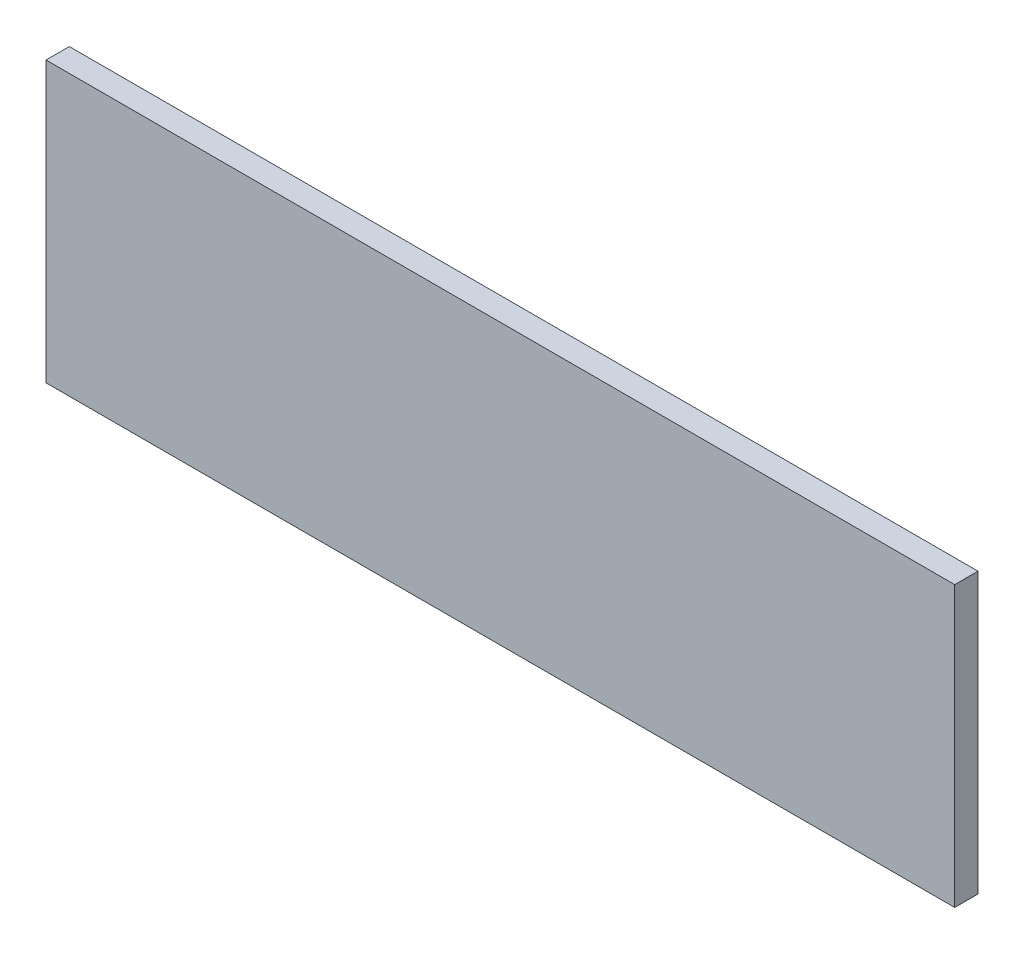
from build123d import *

# Parameters (mm, degrees)
SKETCH1_W           = 247.65
SKETCH1_H           = 76.2
BOSS_EXTRUDE1_DEPTH = 6.35


with BuildPart() as part:
    # Sketch1 → Boss-Extrude1 (new body)
    with BuildSketch(Plane.XY):
        with Locations((123.825, 38.1)):
            Rectangle(SKETCH1_W, SKETCH1_H)
    extrude(amount=BOSS_EXTRUDE1_DEPTH)


solid = part.part
